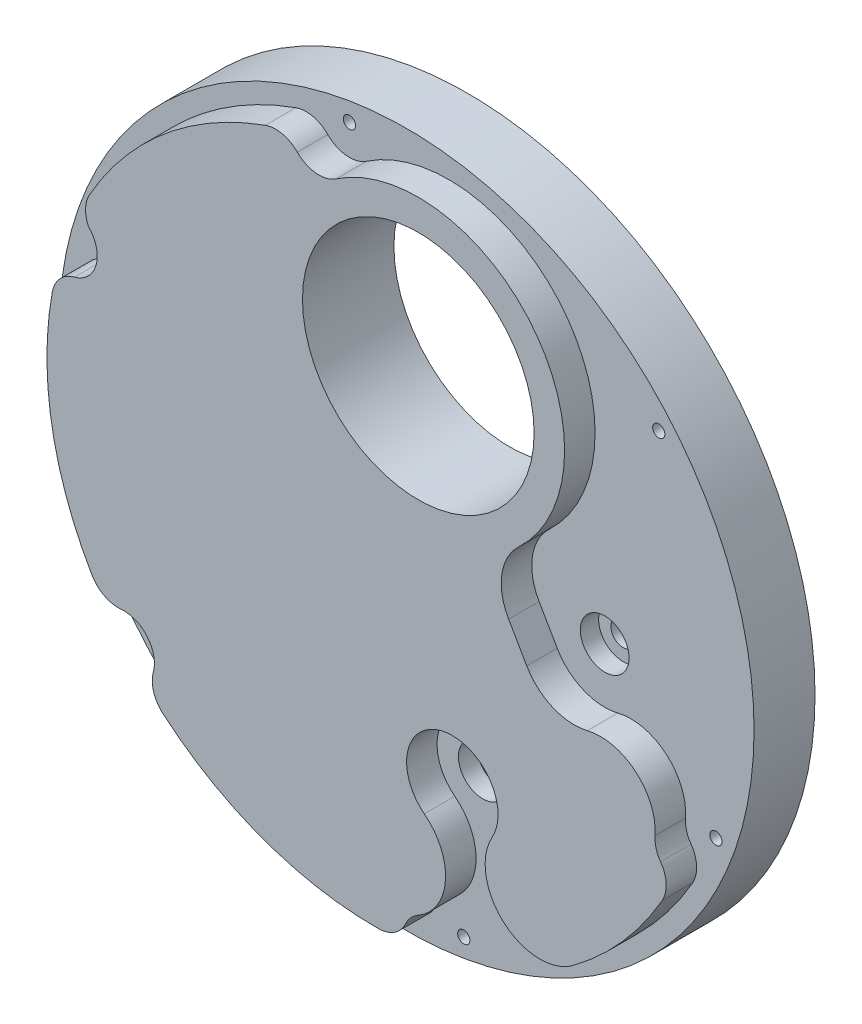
from build123d import *

# Parameters (mm, degrees)
ESQUISSE1_R             = 57
BOSS_EXTRU_1_DEPTH      = 10
ESQUISSE2_R             = 1
ENL_V_MAT_EXTRU_1_DEPTH = 82.228073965
BOSS_EXTRU_2_DEPTH      = 5
ESQUISSE6_R             = 19
ESQUISSE6_R_2           = 2
ENL_V_MAT_EXTRU_2_DEPTH = 82.993902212
ESQUISSE7_R             = 4
ENL_V_MAT_EXTRU_3_DEPTH = 3


with BuildPart() as part:
    # Esquisse1 → Boss.-Extru.1 (new body)
    with BuildSketch(Plane.XY):
        Circle(ESQUISSE1_R)
    extrude(amount=BOSS_EXTRU_1_DEPTH)

    # Esquisse2 → Enl_v. mat.-Extru.1 (cut, through all)
    with BuildSketch(Plane.XY.offset(10)):
        with Locations((-50.743401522, 18.46908774)):
            Circle(ESQUISSE2_R)
        with Locations((-9.377001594, 53.179618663)):
            Circle(ESQUISSE2_R)
        with Locations((-41.366399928, -34.710530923)):
            Circle(ESQUISSE2_R)
        with Locations((9.377001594, -53.179618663)):
            Circle(ESQUISSE2_R)
        with Locations((50.743401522, -18.46908774)):
            Circle(ESQUISSE2_R)
        with Locations((41.366399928, 34.710530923)):
            Circle(ESQUISSE2_R)
    extrude(amount=-ENL_V_MAT_EXTRU_1_DEPTH, mode=Mode.SUBTRACT)

    # Esquisse5 → Boss.-Extru.2 (add)
    with BuildSketch(Plane.XY.offset(10)):
        with BuildLine():
            Line((21.731719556, 0.651208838), (24.705771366, -4.5))
            ThreePointArc((24.705771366, -4.5), (28.965292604, -8.276825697), (34.639043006, -8.742110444))
            ThreePointArc((34.639043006, -8.742110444), (42.580291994, -10.60422047), (45.75578884, -18.117349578))
            ThreePointArc((45.75578884, -18.117349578), (45.928229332, -19.815979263), (46.662134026, -21.357557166))
            ThreePointArc((46.662134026, -21.357557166), (47.574831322, -24.000434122), (46.925852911, -26.720110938))
            ThreePointArc((46.925852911, -26.720110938), (40.45098222, -35.773146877), (32.257618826, -43.306420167))
            ThreePointArc((32.257618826, -43.306420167), (20.936971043, -42.846225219), (19.036976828, -31.676674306))
            ThreePointArc((19.036976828, -31.676674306), (11.012212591, -20.649048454), (7.907207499, -33.929271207))
            ThreePointArc((7.907207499, -33.929271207), (11.374745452, -41.660475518), (6.883735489, -48.845610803))
            ThreePointArc((6.883735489, -48.845610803), (5.684741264, -49.808088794), (4.834879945, -51.089372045))
            ThreePointArc((4.834879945, -51.089372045), (3.002430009, -53.201229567), (0.322631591, -53.999036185))
            ThreePointArc((0.322631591, -53.999036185), (-18.46908774, -50.743401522), (-34.957061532, -41.158278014))
            ThreePointArc((-34.957061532, -41.158278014), (-36.49708601, -38.824581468), (-36.543348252, -36.028928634))
            ThreePointArc((-36.543348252, -36.028928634), (-37.536177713, -31.496592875), (-41.827254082, -29.731814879))
            ThreePointArc((-41.827254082, -29.731814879), (-44.572401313, -29.200795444), (-46.60322132, -27.278925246))
            ThreePointArc((-46.60322132, -27.278925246), (-53.179618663, -9.377001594), (-53.122645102, 9.694564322))
            ThreePointArc((-53.122645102, 9.694564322), (-51.871616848, 12.195112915), (-49.473641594, 13.633003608))
            ThreePointArc((-49.473641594, 13.633003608), (-45.917045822, 17.162837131), (-47.207867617, 22.004621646))
            ThreePointArc((-47.207867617, 22.004621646), (-47.661856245, 24.302176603), (-47.019807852, 26.554428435))
            ThreePointArc((-47.019807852, 26.554428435), (-34.783430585, 41.305120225), (-18.16558357, 50.852842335))
            ThreePointArc((-18.16558357, 50.852842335), (-15.374530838, 51.019694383), (-12.930293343, 49.661932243))
            ThreePointArc((-12.930293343, 49.661932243), (-9.860539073, 48.203054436), (-6.567357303, 49.043690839))
            ThreePointArc((-6.567357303, 49.043690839), (25.645375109, 44.201915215), (23.360399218, 11.707580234))
            ThreePointArc((23.360399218, 11.707580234), (20.622034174, 6.462816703), (21.731719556, 0.651208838))
        make_face()
    extrude(amount=BOSS_EXTRU_2_DEPTH)

    # Esquisse6 → Enl_v. mat.-Extru.2 (cut, through all)
    with BuildSketch(Plane.XY.offset(15)):
        with Locations((6.918935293, 29.191237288)):
            Circle(ESQUISSE6_R)
        with Locations((32.5, 0)):
            Circle(ESQUISSE6_R_2)
        with Locations((12.5, -28)):
            Circle(ESQUISSE6_R_2)
    extrude(amount=-ENL_V_MAT_EXTRU_2_DEPTH, mode=Mode.SUBTRACT)

    # Esquisse7 → Enl_v. mat.-Extru.3 (cut)
    with BuildSketch(Plane.XY.offset(10)):
        with Locations((32.5, 0)):
            Circle(ESQUISSE7_R)
        with Locations((12.5, -28)):
            Circle(ESQUISSE7_R)
    extrude(amount=-ENL_V_MAT_EXTRU_3_DEPTH, mode=Mode.SUBTRACT)


solid = part.part
